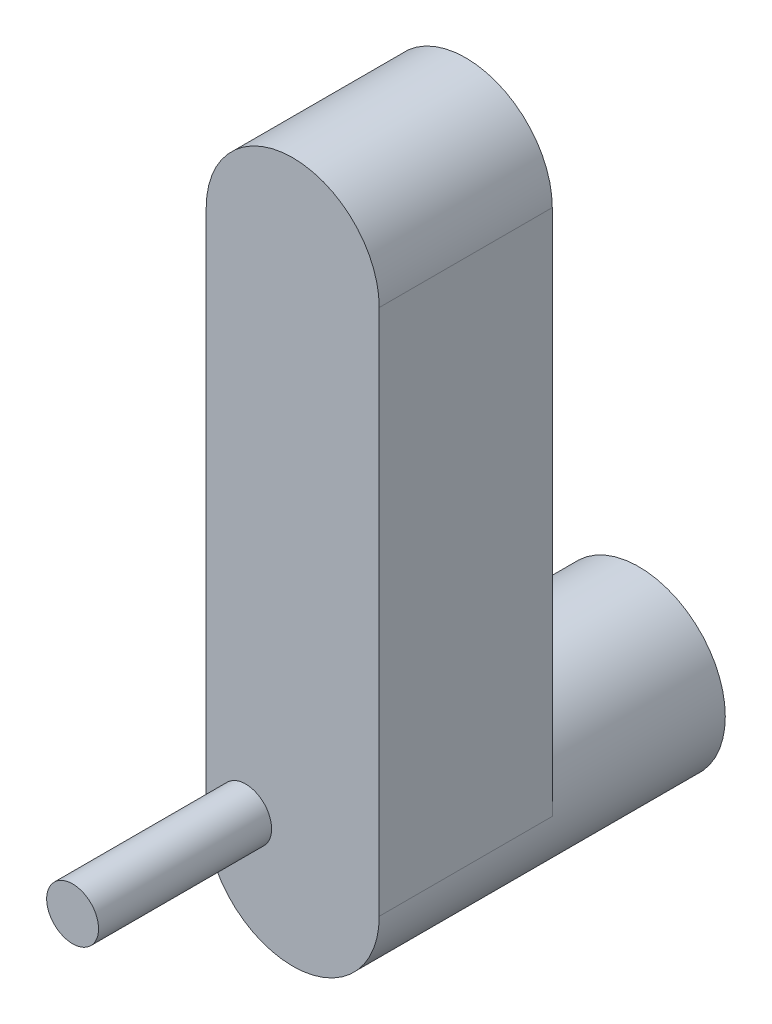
ISO-10303-21;
HEADER;
FILE_DESCRIPTION(('STEP AP214'),'2;1');
FILE_NAME('part.step','',(''),(''),'','','');
FILE_SCHEMA(('AUTOMOTIVE_DESIGN { 1 0 10303 214 1 1 1 1 }'));
ENDSEC;
DATA;
#1=APPLICATION_CONTEXT('core data for automotive mechanical design processes');
#2=APPLICATION_PROTOCOL_DEFINITION('international standard','automotive_design',2000,#1);
#3=PRODUCT_CONTEXT('',#1,'mechanical');
#4=PRODUCT('Part','Part','',(#3));
#5=PRODUCT_RELATED_PRODUCT_CATEGORY('part','',(#4));
#6=PRODUCT_DEFINITION_FORMATION('','',#4);
#7=PRODUCT_DEFINITION_CONTEXT('part definition',#1,'design');
#8=PRODUCT_DEFINITION('design','',#6,#7);
#9=PRODUCT_DEFINITION_SHAPE('','',#8);
#10=(LENGTH_UNIT() NAMED_UNIT(*) SI_UNIT(.MILLI.,.METRE.));
#11=(NAMED_UNIT(*) PLANE_ANGLE_UNIT() SI_UNIT($,.RADIAN.));
#12=(NAMED_UNIT(*) SI_UNIT($,.STERADIAN.) SOLID_ANGLE_UNIT());
#13=UNCERTAINTY_MEASURE_WITH_UNIT(LENGTH_MEASURE(1.E-05),#10,'distance_accuracy_value','');
#14=(GEOMETRIC_REPRESENTATION_CONTEXT(3) GLOBAL_UNCERTAINTY_ASSIGNED_CONTEXT((#13)) GLOBAL_UNIT_ASSIGNED_CONTEXT((#10,
#11,#12)) REPRESENTATION_CONTEXT('',''));
#15=CARTESIAN_POINT('',(0.,0.,0.));
#16=DIRECTION('',(0.,0.,1.));
#17=DIRECTION('',(1.,0.,0.));
#18=AXIS2_PLACEMENT_3D('',#15,#16,#17);
#19=CARTESIAN_POINT('',(0.,0.,20.));
#20=DIRECTION('',(0.,0.,-1.));
#21=DIRECTION('',(-1.,0.,0.));
#22=AXIS2_PLACEMENT_3D('',#19,#20,#21);
#23=CYLINDRICAL_SURFACE('',#22,5.);
#24=CARTESIAN_POINT('',(0.,0.,0.));
#25=DIRECTION('',(0.,0.,1.));
#26=DIRECTION('',(1.,0.,0.));
#27=AXIS2_PLACEMENT_3D('',#24,#25,#26);
#28=CIRCLE('',#27,5.);
#29=CARTESIAN_POINT('',(5.,0.,0.));
#30=VERTEX_POINT('',#29);
#31=EDGE_CURVE('E124',#30,#30,#28,.T.);
#32=ORIENTED_EDGE('',*,*,#31,.T.);
#33=EDGE_LOOP('',(#32));
#34=FACE_BOUND('',#33,.T.);
#35=CARTESIAN_POINT('',(0.,0.,10.));
#36=DIRECTION('',(0.,0.,1.));
#37=DIRECTION('',(1.,0.,0.));
#38=AXIS2_PLACEMENT_3D('',#35,#36,#37);
#39=CIRCLE('',#38,5.);
#40=CARTESIAN_POINT('',(5.,0.,10.));
#41=VERTEX_POINT('',#40);
#42=CARTESIAN_POINT('',(-5.,0.,10.));
#43=VERTEX_POINT('',#42);
#44=EDGE_CURVE('E11',#41,#43,#39,.T.);
#45=ORIENTED_EDGE('',*,*,#44,.F.);
#46=DIRECTION('',(0.,0.,-1.));
#47=VECTOR('',#46,1.);
#48=CARTESIAN_POINT('',(5.,0.,20.));
#49=LINE('',#48,#47);
#50=CARTESIAN_POINT('',(5.,0.,20.));
#51=VERTEX_POINT('',#50);
#52=EDGE_CURVE('E95',#51,#41,#49,.T.);
#53=ORIENTED_EDGE('',*,*,#52,.F.);
#54=CARTESIAN_POINT('',(0.,0.,20.));
#55=DIRECTION('',(0.,0.,1.));
#56=DIRECTION('',(1.,0.,0.));
#57=AXIS2_PLACEMENT_3D('',#54,#55,#56);
#58=CIRCLE('',#57,5.);
#59=CARTESIAN_POINT('',(-5.,0.,20.));
#60=VERTEX_POINT('',#59);
#61=EDGE_CURVE('E49',#60,#51,#58,.T.);
#62=ORIENTED_EDGE('',*,*,#61,.F.);
#63=DIRECTION('',(0.,0.,-1.));
#64=VECTOR('',#63,1.);
#65=CARTESIAN_POINT('',(-5.,0.,20.));
#66=LINE('',#65,#64);
#67=EDGE_CURVE('E105',#60,#43,#66,.T.);
#68=ORIENTED_EDGE('',*,*,#67,.T.);
#69=EDGE_LOOP('',(#45,#53,#62,#68));
#70=FACE_BOUND('',#69,.T.);
#71=ADVANCED_FACE('F41',(#34,#70),#23,.T.);
#72=CARTESIAN_POINT('',(0.,0.,20.));
#73=DIRECTION('',(0.,0.,1.));
#74=DIRECTION('',(1.,0.,0.));
#75=AXIS2_PLACEMENT_3D('',#72,#73,#74);
#76=PLANE('',#75);
#77=CARTESIAN_POINT('',(-2.72186104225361,1.26153575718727,20.));
#78=DIRECTION('',(0.,0.,1.));
#79=DIRECTION('',(1.,0.,0.));
#80=AXIS2_PLACEMENT_3D('',#77,#78,#79);
#81=CIRCLE('',#80,1.5);
#82=CARTESIAN_POINT('',(-1.22186104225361,1.26153575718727,20.));
#83=VERTEX_POINT('',#82);
#84=EDGE_CURVE('E211',#83,#83,#81,.T.);
#85=ORIENTED_EDGE('',*,*,#84,.F.);
#86=EDGE_LOOP('',(#85));
#87=FACE_BOUND('',#86,.T.);
#88=ORIENTED_EDGE('',*,*,#61,.T.);
#89=DIRECTION('',(0.,1.,0.));
#90=VECTOR('',#89,1.);
#91=CARTESIAN_POINT('',(5.,0.,20.));
#92=LINE('',#91,#90);
#93=CARTESIAN_POINT('',(5.,30.469644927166,20.));
#94=VERTEX_POINT('',#93);
#95=EDGE_CURVE('E77',#51,#94,#92,.T.);
#96=ORIENTED_EDGE('',*,*,#95,.T.);
#97=CARTESIAN_POINT('',(0.,30.469644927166,20.));
#98=DIRECTION('',(0.,0.,1.));
#99=DIRECTION('',(1.,0.,0.));
#100=AXIS2_PLACEMENT_3D('',#97,#98,#99);
#101=CIRCLE('',#100,5.);
#102=CARTESIAN_POINT('',(-5.,30.469644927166,20.));
#103=VERTEX_POINT('',#102);
#104=EDGE_CURVE('E81',#94,#103,#101,.T.);
#105=ORIENTED_EDGE('',*,*,#104,.T.);
#106=DIRECTION('',(0.,-1.,0.));
#107=VECTOR('',#106,1.);
#108=CARTESIAN_POINT('',(-5.,0.,20.));
#109=LINE('',#108,#107);
#110=EDGE_CURVE('E102',#103,#60,#109,.T.);
#111=ORIENTED_EDGE('',*,*,#110,.T.);
#112=EDGE_LOOP('',(#88,#96,#105,#111));
#113=FACE_BOUND('',#112,.T.);
#114=ADVANCED_FACE('F79',(#87,#113),#76,.T.);
#115=CARTESIAN_POINT('',(0.,0.,0.));
#116=DIRECTION('',(0.,0.,1.));
#117=DIRECTION('',(1.,0.,0.));
#118=AXIS2_PLACEMENT_3D('',#115,#116,#117);
#119=PLANE('',#118);
#120=ORIENTED_EDGE('',*,*,#31,.F.);
#121=EDGE_LOOP('',(#120));
#122=FACE_BOUND('',#121,.T.);
#123=ADVANCED_FACE('F131',(#122),#119,.F.);
#124=CARTESIAN_POINT('',(0.,0.,10.));
#125=DIRECTION('',(0.,0.,1.));
#126=DIRECTION('',(1.,0.,0.));
#127=AXIS2_PLACEMENT_3D('',#124,#125,#126);
#128=PLANE('',#127);
#129=DIRECTION('',(0.,1.,0.));
#130=VECTOR('',#129,1.);
#131=CARTESIAN_POINT('',(5.,0.,10.));
#132=LINE('',#131,#130);
#133=CARTESIAN_POINT('',(5.,30.469644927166,10.));
#134=VERTEX_POINT('',#133);
#135=EDGE_CURVE('E91',#41,#134,#132,.T.);
#136=ORIENTED_EDGE('',*,*,#135,.F.);
#137=ORIENTED_EDGE('',*,*,#44,.T.);
#138=DIRECTION('',(0.,-1.,0.));
#139=VECTOR('',#138,1.);
#140=CARTESIAN_POINT('',(-5.,0.,10.));
#141=LINE('',#140,#139);
#142=CARTESIAN_POINT('',(-5.,30.469644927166,10.));
#143=VERTEX_POINT('',#142);
#144=EDGE_CURVE('E86',#143,#43,#141,.T.);
#145=ORIENTED_EDGE('',*,*,#144,.F.);
#146=CARTESIAN_POINT('',(0.,30.469644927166,10.));
#147=DIRECTION('',(0.,0.,1.));
#148=DIRECTION('',(1.,0.,0.));
#149=AXIS2_PLACEMENT_3D('',#146,#147,#148);
#150=CIRCLE('',#149,5.);
#151=EDGE_CURVE('E111',#134,#143,#150,.T.);
#152=ORIENTED_EDGE('',*,*,#151,.F.);
#153=EDGE_LOOP('',(#136,#137,#145,#152));
#154=FACE_BOUND('',#153,.T.);
#155=ADVANCED_FACE('F133',(#154),#128,.F.);
#156=CARTESIAN_POINT('',(5.,0.,20.));
#157=DIRECTION('',(-1.,0.,0.));
#158=DIRECTION('',(0.,0.,1.));
#159=AXIS2_PLACEMENT_3D('',#156,#157,#158);
#160=PLANE('',#159);
#161=ORIENTED_EDGE('',*,*,#135,.T.);
#162=DIRECTION('',(0.,0.,-1.));
#163=VECTOR('',#162,1.);
#164=CARTESIAN_POINT('',(5.,30.469644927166,20.));
#165=LINE('',#164,#163);
#166=EDGE_CURVE('E89',#94,#134,#165,.T.);
#167=ORIENTED_EDGE('',*,*,#166,.F.);
#168=ORIENTED_EDGE('',*,*,#95,.F.);
#169=ORIENTED_EDGE('',*,*,#52,.T.);
#170=EDGE_LOOP('',(#161,#167,#168,#169));
#171=FACE_BOUND('',#170,.T.);
#172=ADVANCED_FACE('F90',(#171),#160,.F.);
#173=CARTESIAN_POINT('',(0.,30.469644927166,20.));
#174=DIRECTION('',(0.,0.,-1.));
#175=DIRECTION('',(-1.,0.,0.));
#176=AXIS2_PLACEMENT_3D('',#173,#174,#175);
#177=CYLINDRICAL_SURFACE('',#176,5.);
#178=ORIENTED_EDGE('',*,*,#151,.T.);
#179=DIRECTION('',(0.,0.,-1.));
#180=VECTOR('',#179,1.);
#181=CARTESIAN_POINT('',(-5.,30.469644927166,20.));
#182=LINE('',#181,#180);
#183=EDGE_CURVE('E96',#103,#143,#182,.T.);
#184=ORIENTED_EDGE('',*,*,#183,.F.);
#185=ORIENTED_EDGE('',*,*,#104,.F.);
#186=ORIENTED_EDGE('',*,*,#166,.T.);
#187=EDGE_LOOP('',(#178,#184,#185,#186));
#188=FACE_BOUND('',#187,.T.);
#189=ADVANCED_FACE('F98',(#188),#177,.T.);
#190=CARTESIAN_POINT('',(-5.,0.,20.));
#191=DIRECTION('',(1.,0.,0.));
#192=DIRECTION('',(0.,0.,-1.));
#193=AXIS2_PLACEMENT_3D('',#190,#191,#192);
#194=PLANE('',#193);
#195=ORIENTED_EDGE('',*,*,#144,.T.);
#196=ORIENTED_EDGE('',*,*,#67,.F.);
#197=ORIENTED_EDGE('',*,*,#110,.F.);
#198=ORIENTED_EDGE('',*,*,#183,.T.);
#199=EDGE_LOOP('',(#195,#196,#197,#198));
#200=FACE_BOUND('',#199,.T.);
#201=ADVANCED_FACE('F158',(#200),#194,.F.);
#202=CARTESIAN_POINT('',(-2.72186104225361,1.26153575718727,30.));
#203=DIRECTION('',(0.,0.,-1.));
#204=DIRECTION('',(-1.,0.,0.));
#205=AXIS2_PLACEMENT_3D('',#202,#203,#204);
#206=CYLINDRICAL_SURFACE('',#205,1.5);
#207=CARTESIAN_POINT('',(-2.72186104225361,1.26153575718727,30.));
#208=DIRECTION('',(0.,0.,1.));
#209=DIRECTION('',(1.,0.,0.));
#210=AXIS2_PLACEMENT_3D('',#207,#208,#209);
#211=CIRCLE('',#210,1.5);
#212=CARTESIAN_POINT('',(-1.22186104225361,1.26153575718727,30.));
#213=VERTEX_POINT('',#212);
#214=EDGE_CURVE('E112',#213,#213,#211,.T.);
#215=ORIENTED_EDGE('',*,*,#214,.F.);
#216=EDGE_LOOP('',(#215));
#217=FACE_BOUND('',#216,.T.);
#218=ORIENTED_EDGE('',*,*,#84,.T.);
#219=EDGE_LOOP('',(#218));
#220=FACE_BOUND('',#219,.T.);
#221=ADVANCED_FACE('F163',(#217,#220),#206,.T.);
#222=CARTESIAN_POINT('',(0.,0.,30.));
#223=DIRECTION('',(0.,0.,1.));
#224=DIRECTION('',(1.,0.,0.));
#225=AXIS2_PLACEMENT_3D('',#222,#223,#224);
#226=PLANE('',#225);
#227=ORIENTED_EDGE('',*,*,#214,.T.);
#228=EDGE_LOOP('',(#227));
#229=FACE_BOUND('',#228,.T.);
#230=ADVANCED_FACE('F168',(#229),#226,.T.);
#231=CLOSED_SHELL('',(#71,#114,#123,#155,#172,#189,#201,#221,#230));
#232=MANIFOLD_SOLID_BREP('B2',#231);
#233=ADVANCED_BREP_SHAPE_REPRESENTATION('',(#18,#232),#14);
#234=SHAPE_DEFINITION_REPRESENTATION(#9,#233);
ENDSEC;
END-ISO-10303-21;
